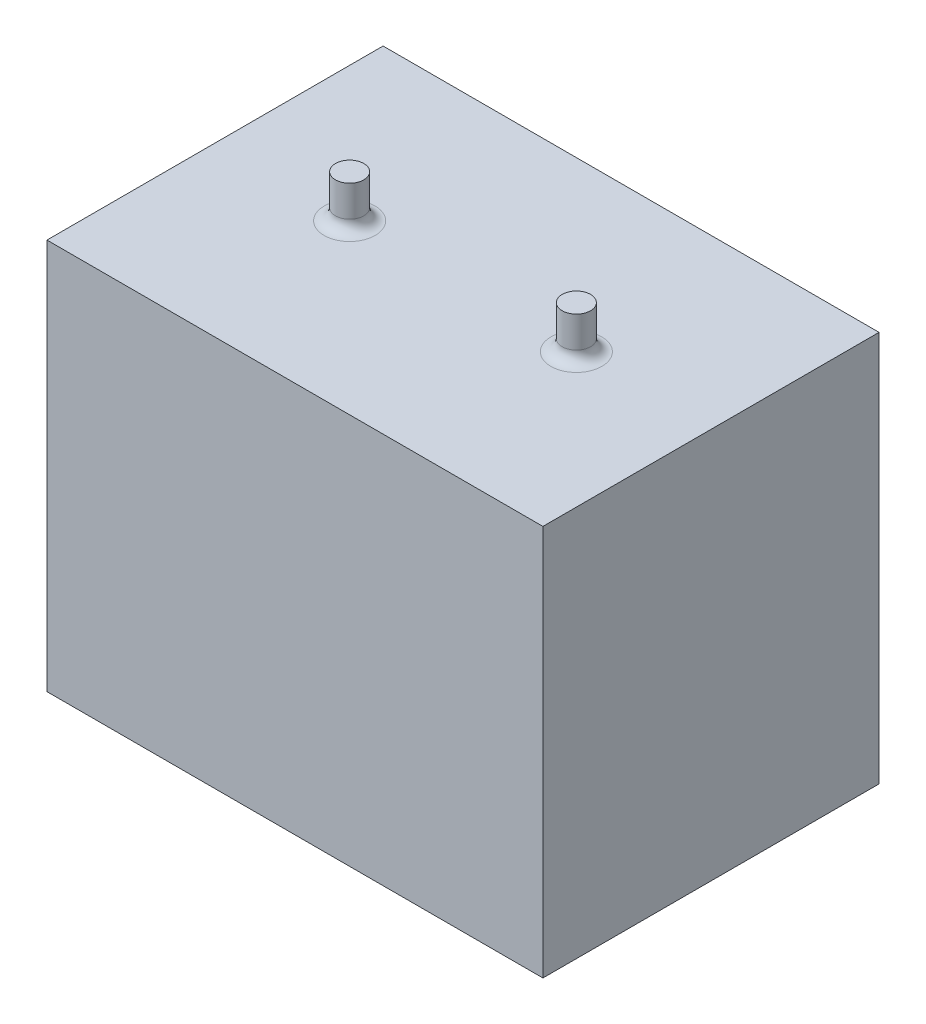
from build123d import *

# Parameters (mm, degrees)
SKETCH1_W           = 222.25
SKETCH1_H           = 175.26
BOSS_EXTRUDE1_DEPTH = 150.622
SKETCH2_R           = 6.35
BOSS_EXTRUDE2_DEPTH = 19.05
FILLET1_R           = 5.08
FILLET2_R           = 5.08


with BuildPart() as part:
    # Sketch1 → Boss-Extrude1 (new body)
    with BuildSketch(Plane.XY):
        with Locations((111.125, 87.63)):
            Rectangle(SKETCH1_W, SKETCH1_H)
    extrude(amount=BOSS_EXTRUDE1_DEPTH)

    # Sketch2 → Boss-Extrude2 (add)
    with BuildSketch(Plane(origin=(0, 175.26, 0), x_dir=(1, 0, 0), z_dir=(0, 1, 0))):
        with Locations(Location((60.325, -75.311, 0), (0, 0, 90))):
            Circle(SKETCH2_R)
        with Locations(Location((161.925, -75.311, 0), (0, 0, 90))):
            Circle(SKETCH2_R)
    extrude(amount=BOSS_EXTRUDE2_DEPTH)

    # Fillet1
    fillet1_edges = [part.edges().sort_by_distance(p)[0] for p in [
        (60.325, 175.26, 81.661),
    ]]
    fillet(fillet1_edges, radius=FILLET1_R)

    # Fillet2
    fillet2_edges = [part.edges().sort_by_distance(p)[0] for p in [
        (161.925, 175.26, 81.661),
    ]]
    fillet(fillet2_edges, radius=FILLET2_R)


solid = part.part
